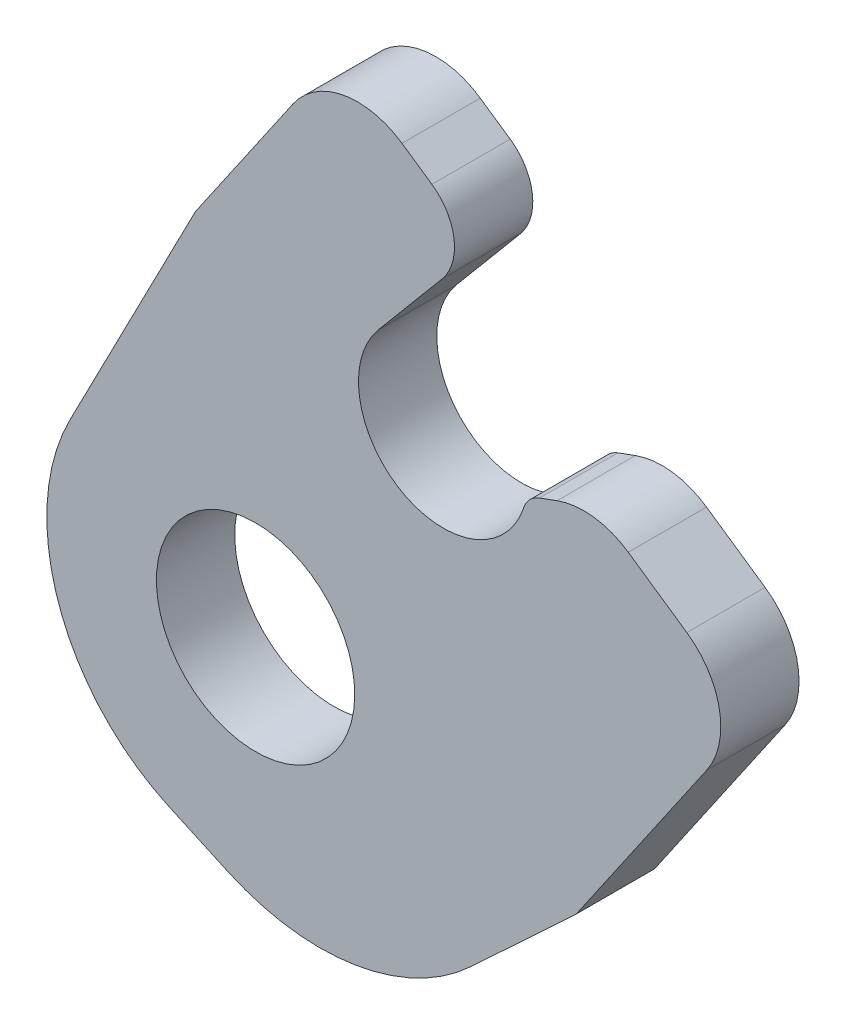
ISO-10303-21;
HEADER;
FILE_DESCRIPTION(('STEP AP214'),'2;1');
FILE_NAME('part.step','',(''),(''),'','','');
FILE_SCHEMA(('AUTOMOTIVE_DESIGN { 1 0 10303 214 1 1 1 1 }'));
ENDSEC;
DATA;
#1=APPLICATION_CONTEXT('core data for automotive mechanical design processes');
#2=APPLICATION_PROTOCOL_DEFINITION('international standard','automotive_design',2000,#1);
#3=PRODUCT_CONTEXT('',#1,'mechanical');
#4=PRODUCT('Part','Part','',(#3));
#5=PRODUCT_RELATED_PRODUCT_CATEGORY('part','',(#4));
#6=PRODUCT_DEFINITION_FORMATION('','',#4);
#7=PRODUCT_DEFINITION_CONTEXT('part definition',#1,'design');
#8=PRODUCT_DEFINITION('design','',#6,#7);
#9=PRODUCT_DEFINITION_SHAPE('','',#8);
#10=(LENGTH_UNIT() NAMED_UNIT(*) SI_UNIT(.MILLI.,.METRE.));
#11=(NAMED_UNIT(*) PLANE_ANGLE_UNIT() SI_UNIT($,.RADIAN.));
#12=(NAMED_UNIT(*) SI_UNIT($,.STERADIAN.) SOLID_ANGLE_UNIT());
#13=UNCERTAINTY_MEASURE_WITH_UNIT(LENGTH_MEASURE(1.E-05),#10,'distance_accuracy_value','');
#14=(GEOMETRIC_REPRESENTATION_CONTEXT(3) GLOBAL_UNCERTAINTY_ASSIGNED_CONTEXT((#13)) GLOBAL_UNIT_ASSIGNED_CONTEXT((#10,
#11,#12)) REPRESENTATION_CONTEXT('',''));
#15=CARTESIAN_POINT('',(0.,0.,0.));
#16=DIRECTION('',(0.,0.,1.));
#17=DIRECTION('',(1.,0.,0.));
#18=AXIS2_PLACEMENT_3D('',#15,#16,#17);
#19=CARTESIAN_POINT('',(-5.5066407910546,10.4664025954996,-3.8));
#20=DIRECTION('',(0.,0.,-1.));
#21=DIRECTION('',(-0.566406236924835,-0.824126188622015,0.));
#22=AXIS2_PLACEMENT_3D('',#19,#20,#21);
#23=CYLINDRICAL_SURFACE('',#22,3.25);
#24=CARTESIAN_POINT('',(-5.5066407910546,10.4664025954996,-3.8));
#25=DIRECTION('',(0.,0.,-1.));
#26=DIRECTION('',(0.566406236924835,0.824126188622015,0.));
#27=AXIS2_PLACEMENT_3D('',#24,#25,#26);
#28=CIRCLE('',#27,3.25);
#29=CARTESIAN_POINT('',(-2.42306138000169,9.43973905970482,-3.8));
#30=VERTEX_POINT('',#29);
#31=CARTESIAN_POINT('',(-7.99628523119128,12.5554623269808,-3.8));
#32=VERTEX_POINT('',#31);
#33=EDGE_CURVE('E135',#30,#32,#28,.T.);
#34=ORIENTED_EDGE('',*,*,#33,.F.);
#35=DIRECTION('',(0.,0.,-1.));
#36=VECTOR('',#35,1.);
#37=CARTESIAN_POINT('',(-2.42306138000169,9.43973905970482,-3.8));
#38=LINE('',#37,#36);
#39=CARTESIAN_POINT('',(-2.42306138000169,9.43973905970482,-6.8));
#40=VERTEX_POINT('',#39);
#41=EDGE_CURVE('E294',#30,#40,#38,.T.);
#42=ORIENTED_EDGE('',*,*,#41,.T.);
#43=CARTESIAN_POINT('',(-5.5066407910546,10.4664025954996,-6.8));
#44=DIRECTION('',(0.,0.,-1.));
#45=DIRECTION('',(0.566406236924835,0.824126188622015,0.));
#46=AXIS2_PLACEMENT_3D('',#43,#44,#45);
#47=CIRCLE('',#46,3.25);
#48=CARTESIAN_POINT('',(-7.99628523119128,12.5554623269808,-6.8));
#49=VERTEX_POINT('',#48);
#50=EDGE_CURVE('E154',#40,#49,#47,.T.);
#51=ORIENTED_EDGE('',*,*,#50,.T.);
#52=DIRECTION('',(0.,0.,-1.));
#53=VECTOR('',#52,1.);
#54=CARTESIAN_POINT('',(-7.99628523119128,12.5554623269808,-3.8));
#55=LINE('',#54,#53);
#56=EDGE_CURVE('E152',#32,#49,#55,.T.);
#57=ORIENTED_EDGE('',*,*,#56,.F.);
#58=EDGE_LOOP('',(#34,#42,#51,#57));
#59=FACE_BOUND('',#58,.T.);
#60=ADVANCED_FACE('F16',(#59),#23,.F.);
#61=CARTESIAN_POINT('',(-7.99628523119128,12.5554623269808,-3.8));
#62=DIRECTION('',(-0.766044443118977,0.642787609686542,0.));
#63=DIRECTION('',(-0.642787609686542,-0.766044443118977,0.));
#64=AXIS2_PLACEMENT_3D('',#61,#62,#63);
#65=PLANE('',#64);
#66=DIRECTION('',(0.642787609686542,0.766044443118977,0.));
#67=VECTOR('',#66,1.);
#68=CARTESIAN_POINT('',(-7.99628523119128,12.5554623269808,-6.8));
#69=LINE('',#68,#67);
#70=CARTESIAN_POINT('',(-5.54445519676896,15.477439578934,-6.8));
#71=VERTEX_POINT('',#70);
#72=EDGE_CURVE('E207',#49,#71,#69,.T.);
#73=ORIENTED_EDGE('',*,*,#72,.T.);
#74=DIRECTION('',(0.,0.,-1.));
#75=VECTOR('',#74,1.);
#76=CARTESIAN_POINT('',(-5.54445519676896,15.477439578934,-3.8));
#77=LINE('',#76,#75);
#78=CARTESIAN_POINT('',(-5.54445519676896,15.477439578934,-3.8));
#79=VERTEX_POINT('',#78);
#80=EDGE_CURVE('E159',#79,#71,#77,.T.);
#81=ORIENTED_EDGE('',*,*,#80,.F.);
#82=DIRECTION('',(0.642787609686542,0.766044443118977,0.));
#83=VECTOR('',#82,1.);
#84=CARTESIAN_POINT('',(-7.99628523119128,12.5554623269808,-3.8));
#85=LINE('',#84,#83);
#86=EDGE_CURVE('E140',#32,#79,#85,.T.);
#87=ORIENTED_EDGE('',*,*,#86,.F.);
#88=ORIENTED_EDGE('',*,*,#56,.T.);
#89=EDGE_LOOP('',(#73,#81,#87,#88));
#90=FACE_BOUND('',#89,.T.);
#91=ADVANCED_FACE('F161',(#90),#65,.F.);
#92=CARTESIAN_POINT('',(-7.07654408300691,16.7630147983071,-3.8));
#93=DIRECTION('',(0.,0.,-1.));
#94=DIRECTION('',(-0.566406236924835,-0.824126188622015,0.));
#95=AXIS2_PLACEMENT_3D('',#92,#93,#94);
#96=CYLINDRICAL_SURFACE('',#95,2.);
#97=CARTESIAN_POINT('',(-7.07654408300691,16.7630147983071,-6.8));
#98=DIRECTION('',(0.,0.,1.));
#99=DIRECTION('',(0.566406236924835,0.824126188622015,0.));
#100=AXIS2_PLACEMENT_3D('',#97,#98,#99);
#101=CIRCLE('',#100,2.);
#102=CARTESIAN_POINT('',(-5.94373160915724,18.4112671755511,-6.8));
#103=VERTEX_POINT('',#102);
#104=EDGE_CURVE('E211',#71,#103,#101,.T.);
#105=ORIENTED_EDGE('',*,*,#104,.T.);
#106=DIRECTION('',(0.,0.,-1.));
#107=VECTOR('',#106,1.);
#108=CARTESIAN_POINT('',(-5.94373160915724,18.4112671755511,-3.8));
#109=LINE('',#108,#107);
#110=CARTESIAN_POINT('',(-5.94373160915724,18.4112671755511,-3.8));
#111=VERTEX_POINT('',#110);
#112=EDGE_CURVE('E263',#111,#103,#109,.T.);
#113=ORIENTED_EDGE('',*,*,#112,.F.);
#114=CARTESIAN_POINT('',(-7.07654408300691,16.7630147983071,-3.8));
#115=DIRECTION('',(0.,0.,1.));
#116=DIRECTION('',(0.566406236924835,0.824126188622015,0.));
#117=AXIS2_PLACEMENT_3D('',#114,#115,#116);
#118=CIRCLE('',#117,2.);
#119=EDGE_CURVE('E165',#79,#111,#118,.T.);
#120=ORIENTED_EDGE('',*,*,#119,.F.);
#121=ORIENTED_EDGE('',*,*,#80,.T.);
#122=EDGE_LOOP('',(#105,#113,#120,#121));
#123=FACE_BOUND('',#122,.T.);
#124=ADVANCED_FACE('F400',(#123),#96,.T.);
#125=CARTESIAN_POINT('',(-5.94373160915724,18.4112671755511,-3.8));
#126=DIRECTION('',(-0.566406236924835,-0.824126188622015,0.));
#127=DIRECTION('',(0.,0.,1.));
#128=AXIS2_PLACEMENT_3D('',#125,#126,#127);
#129=PLANE('',#128);
#130=DIRECTION('',(-0.824126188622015,0.566406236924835,0.));
#131=VECTOR('',#130,1.);
#132=CARTESIAN_POINT('',(-5.94373160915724,18.4112671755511,-6.8));
#133=LINE('',#132,#131);
#134=CARTESIAN_POINT('',(-7.08907017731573,19.1984365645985,-6.8));
#135=VERTEX_POINT('',#134);
#136=EDGE_CURVE('E214',#103,#135,#133,.T.);
#137=ORIENTED_EDGE('',*,*,#136,.T.);
#138=DIRECTION('',(0.,0.,-1.));
#139=VECTOR('',#138,1.);
#140=CARTESIAN_POINT('',(-7.08907017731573,19.1984365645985,-3.8));
#141=LINE('',#140,#139);
#142=CARTESIAN_POINT('',(-7.08907017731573,19.1984365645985,-3.8));
#143=VERTEX_POINT('',#142);
#144=EDGE_CURVE('E260',#143,#135,#141,.T.);
#145=ORIENTED_EDGE('',*,*,#144,.F.);
#146=DIRECTION('',(-0.824126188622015,0.566406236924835,0.));
#147=VECTOR('',#146,1.);
#148=CARTESIAN_POINT('',(-5.94373160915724,18.4112671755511,-3.8));
#149=LINE('',#148,#147);
#150=EDGE_CURVE('E172',#111,#143,#149,.T.);
#151=ORIENTED_EDGE('',*,*,#150,.F.);
#152=ORIENTED_EDGE('',*,*,#112,.T.);
#153=EDGE_LOOP('',(#137,#145,#151,#152));
#154=FACE_BOUND('',#153,.T.);
#155=ADVANCED_FACE('F405',(#154),#129,.F.);
#156=CARTESIAN_POINT('',(-8.78828888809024,16.7260579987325,-3.8));
#157=DIRECTION('',(0.,0.,-1.));
#158=DIRECTION('',(-0.566406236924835,-0.824126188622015,0.));
#159=AXIS2_PLACEMENT_3D('',#156,#157,#158);
#160=CYLINDRICAL_SURFACE('',#159,3.);
#161=CARTESIAN_POINT('',(-8.78828888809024,16.7260579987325,-6.8));
#162=DIRECTION('',(0.,0.,1.));
#163=DIRECTION('',(0.566406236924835,0.824126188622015,0.));
#164=AXIS2_PLACEMENT_3D('',#161,#162,#163);
#165=CIRCLE('',#164,3.);
#166=CARTESIAN_POINT('',(-11.2606674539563,18.4252767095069,-6.8));
#167=VERTEX_POINT('',#166);
#168=EDGE_CURVE('E217',#135,#167,#165,.T.);
#169=ORIENTED_EDGE('',*,*,#168,.T.);
#170=DIRECTION('',(0.,0.,-1.));
#171=VECTOR('',#170,1.);
#172=CARTESIAN_POINT('',(-11.2606674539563,18.4252767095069,-3.8));
#173=LINE('',#172,#171);
#174=CARTESIAN_POINT('',(-11.2606674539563,18.4252767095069,-3.8));
#175=VERTEX_POINT('',#174);
#176=EDGE_CURVE('E256',#175,#167,#173,.T.);
#177=ORIENTED_EDGE('',*,*,#176,.F.);
#178=CARTESIAN_POINT('',(-8.78828888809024,16.7260579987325,-3.8));
#179=DIRECTION('',(0.,0.,1.));
#180=DIRECTION('',(0.566406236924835,0.824126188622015,0.));
#181=AXIS2_PLACEMENT_3D('',#178,#179,#180);
#182=CIRCLE('',#181,3.);
#183=EDGE_CURVE('E178',#143,#175,#182,.T.);
#184=ORIENTED_EDGE('',*,*,#183,.F.);
#185=ORIENTED_EDGE('',*,*,#144,.T.);
#186=EDGE_LOOP('',(#169,#177,#184,#185));
#187=FACE_BOUND('',#186,.T.);
#188=ADVANCED_FACE('F434',(#187),#160,.T.);
#189=CARTESIAN_POINT('',(-11.2606674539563,18.4252767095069,-3.8));
#190=DIRECTION('',(0.824126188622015,-0.566406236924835,0.));
#191=DIRECTION('',(0.,0.,-1.));
#192=AXIS2_PLACEMENT_3D('',#189,#190,#191);
#193=PLANE('',#192);
#194=DIRECTION('',(-0.566406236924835,-0.824126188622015,0.));
#195=VECTOR('',#194,1.);
#196=CARTESIAN_POINT('',(-11.2606674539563,18.4252767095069,-6.8));
#197=LINE('',#196,#195);
#198=CARTESIAN_POINT('',(-15.0037905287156,12.9789988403,-6.8));
#199=VERTEX_POINT('',#198);
#200=EDGE_CURVE('E220',#167,#199,#197,.T.);
#201=ORIENTED_EDGE('',*,*,#200,.T.);
#202=DIRECTION('',(0.,0.,-1.));
#203=VECTOR('',#202,1.);
#204=CARTESIAN_POINT('',(-15.0037905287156,12.9789988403,-3.8));
#205=LINE('',#204,#203);
#206=CARTESIAN_POINT('',(-15.0037905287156,12.9789988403,-3.8));
#207=VERTEX_POINT('',#206);
#208=EDGE_CURVE('E252',#207,#199,#205,.T.);
#209=ORIENTED_EDGE('',*,*,#208,.F.);
#210=DIRECTION('',(-0.566406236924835,-0.824126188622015,0.));
#211=VECTOR('',#210,1.);
#212=CARTESIAN_POINT('',(-11.2606674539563,18.4252767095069,-3.8));
#213=LINE('',#212,#211);
#214=EDGE_CURVE('E181',#175,#207,#213,.T.);
#215=ORIENTED_EDGE('',*,*,#214,.F.);
#216=ORIENTED_EDGE('',*,*,#176,.T.);
#217=EDGE_LOOP('',(#201,#209,#215,#216));
#218=FACE_BOUND('',#217,.T.);
#219=ADVANCED_FACE('F463',(#218),#193,.F.);
#220=CARTESIAN_POINT('',(-15.0037905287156,12.9789988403,-3.8));
#221=DIRECTION('',(0.888617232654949,-0.458649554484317,0.));
#222=DIRECTION('',(0.458649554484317,0.888617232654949,0.));
#223=AXIS2_PLACEMENT_3D('',#220,#221,#222);
#224=PLANE('',#223);
#225=DIRECTION('',(-0.458649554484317,-0.888617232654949,0.));
#226=VECTOR('',#225,1.);
#227=CARTESIAN_POINT('',(-15.0037905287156,12.9789988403,-6.8));
#228=LINE('',#227,#226);
#229=CARTESIAN_POINT('',(-19.8089378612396,3.66919643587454,-6.8));
#230=VERTEX_POINT('',#229);
#231=EDGE_CURVE('E223',#199,#230,#228,.T.);
#232=ORIENTED_EDGE('',*,*,#231,.T.);
#233=DIRECTION('',(0.,0.,-1.));
#234=VECTOR('',#233,1.);
#235=CARTESIAN_POINT('',(-19.8089378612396,3.66919643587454,-3.8));
#236=LINE('',#235,#234);
#237=CARTESIAN_POINT('',(-19.8089378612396,3.66919643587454,-3.8));
#238=VERTEX_POINT('',#237);
#239=EDGE_CURVE('E248',#238,#230,#236,.T.);
#240=ORIENTED_EDGE('',*,*,#239,.F.);
#241=DIRECTION('',(-0.458649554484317,-0.888617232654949,0.));
#242=VECTOR('',#241,1.);
#243=CARTESIAN_POINT('',(-15.0037905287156,12.9789988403,-3.8));
#244=LINE('',#243,#242);
#245=EDGE_CURVE('E184',#207,#238,#244,.T.);
#246=ORIENTED_EDGE('',*,*,#245,.F.);
#247=ORIENTED_EDGE('',*,*,#208,.T.);
#248=EDGE_LOOP('',(#232,#240,#246,#247));
#249=FACE_BOUND('',#248,.T.);
#250=ADVANCED_FACE('F357',(#249),#224,.F.);
#251=CARTESIAN_POINT('',(-12.7,0.,-3.8));
#252=DIRECTION('',(0.,0.,-1.));
#253=DIRECTION('',(-0.566406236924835,-0.824126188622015,0.));
#254=AXIS2_PLACEMENT_3D('',#251,#252,#253);
#255=CYLINDRICAL_SURFACE('',#254,8.);
#256=CARTESIAN_POINT('',(-12.7,0.,-6.8));
#257=DIRECTION('',(0.,0.,1.));
#258=DIRECTION('',(0.566406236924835,0.824126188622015,0.));
#259=AXIS2_PLACEMENT_3D('',#256,#257,#258);
#260=CIRCLE('',#259,8.);
#261=CARTESIAN_POINT('',(-16.0175459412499,-7.27969016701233,-6.8));
#262=VERTEX_POINT('',#261);
#263=EDGE_CURVE('E226',#230,#262,#260,.T.);
#264=ORIENTED_EDGE('',*,*,#263,.T.);
#265=DIRECTION('',(0.,0.,-1.));
#266=VECTOR('',#265,1.);
#267=CARTESIAN_POINT('',(-16.0175459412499,-7.27969016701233,-3.8));
#268=LINE('',#267,#266);
#269=CARTESIAN_POINT('',(-16.0175459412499,-7.27969016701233,-3.8));
#270=VERTEX_POINT('',#269);
#271=EDGE_CURVE('E244',#270,#262,#268,.T.);
#272=ORIENTED_EDGE('',*,*,#271,.F.);
#273=CARTESIAN_POINT('',(-12.7,0.,-3.8));
#274=DIRECTION('',(0.,0.,1.));
#275=DIRECTION('',(0.566406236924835,0.824126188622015,0.));
#276=AXIS2_PLACEMENT_3D('',#273,#274,#275);
#277=CIRCLE('',#276,8.);
#278=EDGE_CURVE('E187',#238,#270,#277,.T.);
#279=ORIENTED_EDGE('',*,*,#278,.F.);
#280=ORIENTED_EDGE('',*,*,#239,.T.);
#281=EDGE_LOOP('',(#264,#272,#279,#280));
#282=FACE_BOUND('',#281,.T.);
#283=ADVANCED_FACE('F351',(#282),#255,.T.);
#284=CARTESIAN_POINT('',(-16.0175459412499,-7.27969016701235,-3.8));
#285=DIRECTION('',(0.414693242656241,0.909961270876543,0.));
#286=DIRECTION('',(-0.909961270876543,0.414693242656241,0.));
#287=AXIS2_PLACEMENT_3D('',#284,#285,#286);
#288=PLANE('',#287);
#289=DIRECTION('',(0.909961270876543,-0.414693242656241,0.));
#290=VECTOR('',#289,1.);
#291=CARTESIAN_POINT('',(-16.0175459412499,-7.27969016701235,-6.8));
#292=LINE('',#291,#290);
#293=CARTESIAN_POINT('',(-13.7560568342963,-8.31031012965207,-6.8));
#294=VERTEX_POINT('',#293);
#295=EDGE_CURVE('E229',#262,#294,#292,.T.);
#296=ORIENTED_EDGE('',*,*,#295,.T.);
#297=DIRECTION('',(0.,0.,-1.));
#298=VECTOR('',#297,1.);
#299=CARTESIAN_POINT('',(-13.7560568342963,-8.31031012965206,-3.8));
#300=LINE('',#299,#298);
#301=CARTESIAN_POINT('',(-13.7560568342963,-8.31031012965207,-3.8));
#302=VERTEX_POINT('',#301);
#303=EDGE_CURVE('E25',#294,#302,#300,.F.);
#304=ORIENTED_EDGE('',*,*,#303,.T.);
#305=DIRECTION('',(0.909961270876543,-0.414693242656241,0.));
#306=VECTOR('',#305,1.);
#307=CARTESIAN_POINT('',(-16.0175459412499,-7.27969016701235,-3.8));
#308=LINE('',#307,#306);
#309=EDGE_CURVE('E190',#270,#302,#308,.T.);
#310=ORIENTED_EDGE('',*,*,#309,.F.);
#311=ORIENTED_EDGE('',*,*,#271,.T.);
#312=EDGE_LOOP('',(#296,#304,#310,#311));
#313=FACE_BOUND('',#312,.T.);
#314=ADVANCED_FACE('F356',(#313),#288,.F.);
#315=CARTESIAN_POINT('',(-8.95480129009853,-11.0076950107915,-3.8));
#316=DIRECTION('',(-0.681998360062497,0.731353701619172,0.));
#317=DIRECTION('',(-0.731353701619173,-0.681998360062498,0.));
#318=AXIS2_PLACEMENT_3D('',#315,#316,#317);
#319=PLANE('',#318);
#320=DIRECTION('',(0.731353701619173,0.681998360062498,0.));
#321=VECTOR('',#320,1.);
#322=CARTESIAN_POINT('',(-8.95480129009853,-11.0076950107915,-3.8));
#323=LINE('',#322,#321);
#324=CARTESIAN_POINT('',(-4.434178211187,-6.7921457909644,-3.8));
#325=VERTEX_POINT('',#324);
#326=CARTESIAN_POINT('',(-0.410421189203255,-3.03993166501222,-3.8));
#327=VERTEX_POINT('',#326);
#328=EDGE_CURVE('E193',#325,#327,#323,.T.);
#329=ORIENTED_EDGE('',*,*,#328,.F.);
#330=DIRECTION('',(0.,0.,-1.));
#331=VECTOR('',#330,1.);
#332=CARTESIAN_POINT('',(-4.43417821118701,-6.79214579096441,-3.8));
#333=LINE('',#332,#331);
#334=CARTESIAN_POINT('',(-4.434178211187,-6.7921457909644,-6.8));
#335=VERTEX_POINT('',#334);
#336=EDGE_CURVE('E305',#325,#335,#333,.T.);
#337=ORIENTED_EDGE('',*,*,#336,.T.);
#338=DIRECTION('',(0.731353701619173,0.681998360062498,0.));
#339=VECTOR('',#338,1.);
#340=CARTESIAN_POINT('',(-8.95480129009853,-11.0076950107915,-6.8));
#341=LINE('',#340,#339);
#342=CARTESIAN_POINT('',(-0.410421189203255,-3.03993166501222,-6.8));
#343=VERTEX_POINT('',#342);
#344=EDGE_CURVE('E232',#335,#343,#341,.T.);
#345=ORIENTED_EDGE('',*,*,#344,.T.);
#346=DIRECTION('',(0.,0.,-1.));
#347=VECTOR('',#346,1.);
#348=CARTESIAN_POINT('',(-0.410421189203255,-3.03993166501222,-3.8));
#349=LINE('',#348,#347);
#350=EDGE_CURVE('E204',#327,#343,#349,.T.);
#351=ORIENTED_EDGE('',*,*,#350,.F.);
#352=EDGE_LOOP('',(#329,#337,#345,#351));
#353=FACE_BOUND('',#352,.T.);
#354=ADVANCED_FACE('F393',(#353),#319,.F.);
#355=CARTESIAN_POINT('',(-0.410421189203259,-3.03993166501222,-3.8));
#356=DIRECTION('',(-0.824126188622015,0.566406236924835,0.));
#357=DIRECTION('',(0.,0.,1.));
#358=AXIS2_PLACEMENT_3D('',#355,#356,#357);
#359=PLANE('',#358);
#360=DIRECTION('',(0.566406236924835,0.824126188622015,0.));
#361=VECTOR('',#360,1.);
#362=CARTESIAN_POINT('',(-0.410421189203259,-3.03993166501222,-6.8));
#363=LINE('',#362,#361);
#364=CARTESIAN_POINT('',(4.59909828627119,4.24896440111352,-6.8));
#365=VERTEX_POINT('',#364);
#366=EDGE_CURVE('E235',#343,#365,#363,.T.);
#367=ORIENTED_EDGE('',*,*,#366,.T.);
#368=DIRECTION('',(0.,0.,1.));
#369=VECTOR('',#368,1.);
#370=CARTESIAN_POINT('',(4.59909828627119,4.24896440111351,-3.8));
#371=LINE('',#370,#369);
#372=CARTESIAN_POINT('',(4.59909828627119,4.24896440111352,-3.8));
#373=VERTEX_POINT('',#372);
#374=EDGE_CURVE('E290',#365,#373,#371,.T.);
#375=ORIENTED_EDGE('',*,*,#374,.T.);
#376=DIRECTION('',(0.566406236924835,0.824126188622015,0.));
#377=VECTOR('',#376,1.);
#378=CARTESIAN_POINT('',(-0.410421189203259,-3.03993166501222,-3.8));
#379=LINE('',#378,#377);
#380=EDGE_CURVE('E196',#327,#373,#379,.T.);
#381=ORIENTED_EDGE('',*,*,#380,.F.);
#382=ORIENTED_EDGE('',*,*,#350,.T.);
#383=EDGE_LOOP('',(#367,#375,#381,#382));
#384=FACE_BOUND('',#383,.T.);
#385=ADVANCED_FACE('F416',(#384),#359,.F.);
#386=CARTESIAN_POINT('',(-12.7,0.,-3.8));
#387=DIRECTION('',(0.,0.,-1.));
#388=DIRECTION('',(-0.566406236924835,-0.824126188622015,0.));
#389=AXIS2_PLACEMENT_3D('',#386,#387,#388);
#390=CYLINDRICAL_SURFACE('',#389,3.8);
#391=CARTESIAN_POINT('',(-12.7,0.,-3.8));
#392=DIRECTION('',(0.,0.,1.));
#393=DIRECTION('',(0.566406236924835,0.824126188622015,0.));
#394=AXIS2_PLACEMENT_3D('',#391,#392,#393);
#395=CIRCLE('',#394,3.8);
#396=CARTESIAN_POINT('',(-10.5476562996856,3.13167951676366,-3.8));
#397=VERTEX_POINT('',#396);
#398=EDGE_CURVE('E200',#397,#397,#395,.T.);
#399=ORIENTED_EDGE('',*,*,#398,.T.);
#400=EDGE_LOOP('',(#399));
#401=FACE_BOUND('',#400,.T.);
#402=CARTESIAN_POINT('',(-12.7,0.,-6.8));
#403=DIRECTION('',(0.,0.,1.));
#404=DIRECTION('',(0.566406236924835,0.824126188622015,0.));
#405=AXIS2_PLACEMENT_3D('',#402,#403,#404);
#406=CIRCLE('',#405,3.8);
#407=CARTESIAN_POINT('',(-10.5476562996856,3.13167951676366,-6.8));
#408=VERTEX_POINT('',#407);
#409=EDGE_CURVE('E149',#408,#408,#406,.T.);
#410=ORIENTED_EDGE('',*,*,#409,.F.);
#411=EDGE_LOOP('',(#410));
#412=FACE_BOUND('',#411,.T.);
#413=ADVANCED_FACE('F445',(#401,#412),#390,.F.);
#414=CARTESIAN_POINT('',(1.68671841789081,20.9328051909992,-3.8));
#415=DIRECTION('',(0.,0.,-1.));
#416=DIRECTION('',(-0.566406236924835,-0.824126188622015,0.));
#417=AXIS2_PLACEMENT_3D('',#414,#415,#416);
#418=PLANE('',#417);
#419=ORIENTED_EDGE('',*,*,#309,.T.);
#420=CARTESIAN_POINT('',(-10.2311642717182,-0.575639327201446,-3.8));
#421=DIRECTION('',(0.,0.,-1.));
#422=DIRECTION('',(-1.,0.,0.));
#423=AXIS2_PLACEMENT_3D('',#420,#421,#422);
#424=CIRCLE('',#423,8.5);
#425=EDGE_CURVE('E11',#302,#325,#424,.F.);
#426=ORIENTED_EDGE('',*,*,#425,.T.);
#427=ORIENTED_EDGE('',*,*,#328,.T.);
#428=ORIENTED_EDGE('',*,*,#380,.T.);
#429=CARTESIAN_POINT('',(2.12671972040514,5.94818311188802,-3.8));
#430=DIRECTION('',(0.,0.,-1.));
#431=DIRECTION('',(-1.,0.,0.));
#432=AXIS2_PLACEMENT_3D('',#429,#430,#431);
#433=CIRCLE('',#432,3.);
#434=CARTESIAN_POINT('',(3.82593843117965,8.42056167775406,-3.8));
#435=VERTEX_POINT('',#434);
#436=EDGE_CURVE('E275',#373,#435,#433,.F.);
#437=ORIENTED_EDGE('',*,*,#436,.T.);
#438=DIRECTION('',(-0.824126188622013,0.566406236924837,0.));
#439=VECTOR('',#438,1.);
#440=CARTESIAN_POINT('',(6.32221306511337,6.70491965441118,-3.8));
#441=LINE('',#440,#439);
#442=CARTESIAN_POINT('',(1.58183557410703,9.96289084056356,-3.8));
#443=VERTEX_POINT('',#442);
#444=EDGE_CURVE('E594',#435,#443,#441,.T.);
#445=ORIENTED_EDGE('',*,*,#444,.T.);
#446=CARTESIAN_POINT('',(-0.117383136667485,7.49051227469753,-3.8));
#447=DIRECTION('',(0.,0.,-1.));
#448=DIRECTION('',(-1.,0.,0.));
#449=AXIS2_PLACEMENT_3D('',#446,#447,#448);
#450=CIRCLE('',#449,3.);
#451=CARTESIAN_POINT('',(-1.14773941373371,10.3080228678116,-3.8));
#452=VERTEX_POINT('',#451);
#453=EDGE_CURVE('E278',#443,#452,#450,.F.);
#454=ORIENTED_EDGE('',*,*,#453,.T.);
#455=DIRECTION('',(-0.939170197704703,-0.34345209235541,0.));
#456=VECTOR('',#455,1.);
#457=CARTESIAN_POINT('',(0.306091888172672,10.8396851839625,-3.8));
#458=LINE('',#457,#456);
#459=CARTESIAN_POINT('',(-1.81771980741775,10.0630127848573,-3.8));
#460=VERTEX_POINT('',#459);
#461=EDGE_CURVE('E590',#452,#460,#458,.T.);
#462=ORIENTED_EDGE('',*,*,#461,.T.);
#463=CARTESIAN_POINT('',(-1.47426771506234,9.12384258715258,-3.8));
#464=DIRECTION('',(0.,0.,-1.));
#465=DIRECTION('',(-1.,0.,0.));
#466=AXIS2_PLACEMENT_3D('',#463,#464,#465);
#467=CIRCLE('',#466,1.);
#468=EDGE_CURVE('E144',#460,#30,#467,.F.);
#469=ORIENTED_EDGE('',*,*,#468,.T.);
#470=ORIENTED_EDGE('',*,*,#33,.T.);
#471=ORIENTED_EDGE('',*,*,#86,.T.);
#472=ORIENTED_EDGE('',*,*,#119,.T.);
#473=ORIENTED_EDGE('',*,*,#150,.T.);
#474=ORIENTED_EDGE('',*,*,#183,.T.);
#475=ORIENTED_EDGE('',*,*,#214,.T.);
#476=ORIENTED_EDGE('',*,*,#245,.T.);
#477=ORIENTED_EDGE('',*,*,#278,.T.);
#478=EDGE_LOOP('',(#419,#426,#427,#428,#437,#445,#454,#462,#469,#470,#471,#472,#473,#474,#475,
#476,#477));
#479=FACE_BOUND('',#478,.T.);
#480=ORIENTED_EDGE('',*,*,#398,.F.);
#481=EDGE_LOOP('',(#480));
#482=FACE_BOUND('',#481,.T.);
#483=ADVANCED_FACE('F137',(#479,#482),#418,.F.);
#484=CARTESIAN_POINT('',(1.68671841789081,20.9328051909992,-6.8));
#485=DIRECTION('',(0.,0.,-1.));
#486=DIRECTION('',(-0.566406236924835,-0.824126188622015,0.));
#487=AXIS2_PLACEMENT_3D('',#484,#485,#486);
#488=PLANE('',#487);
#489=ORIENTED_EDGE('',*,*,#344,.F.);
#490=CARTESIAN_POINT('',(-10.2311642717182,-0.575639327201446,-6.8));
#491=DIRECTION('',(0.,0.,-1.));
#492=DIRECTION('',(-1.,0.,0.));
#493=AXIS2_PLACEMENT_3D('',#490,#491,#492);
#494=CIRCLE('',#493,8.5);
#495=EDGE_CURVE('E39',#335,#294,#494,.T.);
#496=ORIENTED_EDGE('',*,*,#495,.T.);
#497=ORIENTED_EDGE('',*,*,#295,.F.);
#498=ORIENTED_EDGE('',*,*,#263,.F.);
#499=ORIENTED_EDGE('',*,*,#231,.F.);
#500=ORIENTED_EDGE('',*,*,#200,.F.);
#501=ORIENTED_EDGE('',*,*,#168,.F.);
#502=ORIENTED_EDGE('',*,*,#136,.F.);
#503=ORIENTED_EDGE('',*,*,#104,.F.);
#504=ORIENTED_EDGE('',*,*,#72,.F.);
#505=ORIENTED_EDGE('',*,*,#50,.F.);
#506=CARTESIAN_POINT('',(-1.47426771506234,9.12384258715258,-6.8));
#507=DIRECTION('',(0.,0.,-1.));
#508=DIRECTION('',(-1.,0.,0.));
#509=AXIS2_PLACEMENT_3D('',#506,#507,#508);
#510=CIRCLE('',#509,1.);
#511=CARTESIAN_POINT('',(-1.81771980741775,10.0630127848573,-6.8));
#512=VERTEX_POINT('',#511);
#513=EDGE_CURVE('E297',#40,#512,#510,.T.);
#514=ORIENTED_EDGE('',*,*,#513,.T.);
#515=DIRECTION('',(-0.939170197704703,-0.34345209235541,0.));
#516=VECTOR('',#515,1.);
#517=CARTESIAN_POINT('',(0.306091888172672,10.8396851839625,-6.8));
#518=LINE('',#517,#516);
#519=CARTESIAN_POINT('',(-1.14773941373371,10.3080228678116,-6.8));
#520=VERTEX_POINT('',#519);
#521=EDGE_CURVE('E208',#520,#512,#518,.T.);
#522=ORIENTED_EDGE('',*,*,#521,.F.);
#523=CARTESIAN_POINT('',(-0.117383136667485,7.49051227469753,-6.8));
#524=DIRECTION('',(0.,0.,-1.));
#525=DIRECTION('',(-1.,0.,0.));
#526=AXIS2_PLACEMENT_3D('',#523,#524,#525);
#527=CIRCLE('',#526,3.);
#528=CARTESIAN_POINT('',(1.58183557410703,9.96289084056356,-6.8));
#529=VERTEX_POINT('',#528);
#530=EDGE_CURVE('E287',#520,#529,#527,.T.);
#531=ORIENTED_EDGE('',*,*,#530,.T.);
#532=DIRECTION('',(-0.824126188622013,0.566406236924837,0.));
#533=VECTOR('',#532,1.);
#534=CARTESIAN_POINT('',(6.32221306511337,6.70491965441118,-6.8));
#535=LINE('',#534,#533);
#536=CARTESIAN_POINT('',(3.82593843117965,8.42056167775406,-6.8));
#537=VERTEX_POINT('',#536);
#538=EDGE_CURVE('E593',#537,#529,#535,.T.);
#539=ORIENTED_EDGE('',*,*,#538,.F.);
#540=CARTESIAN_POINT('',(2.12671972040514,5.94818311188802,-6.8));
#541=DIRECTION('',(0.,0.,-1.));
#542=DIRECTION('',(-1.,0.,0.));
#543=AXIS2_PLACEMENT_3D('',#540,#541,#542);
#544=CIRCLE('',#543,3.);
#545=EDGE_CURVE('E284',#537,#365,#544,.T.);
#546=ORIENTED_EDGE('',*,*,#545,.T.);
#547=ORIENTED_EDGE('',*,*,#366,.F.);
#548=EDGE_LOOP('',(#489,#496,#497,#498,#499,#500,#501,#502,#503,#504,#505,#514,#522,#531,#539,
#546,#547));
#549=FACE_BOUND('',#548,.T.);
#550=ORIENTED_EDGE('',*,*,#409,.T.);
#551=EDGE_LOOP('',(#550));
#552=FACE_BOUND('',#551,.T.);
#553=ADVANCED_FACE('F317',(#549,#552),#488,.T.);
#554=CARTESIAN_POINT('',(6.32221306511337,6.70491965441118,-6.8));
#555=DIRECTION('',(0.566406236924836,0.824126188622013,0.));
#556=DIRECTION('',(-0.824126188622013,0.566406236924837,0.));
#557=AXIS2_PLACEMENT_3D('',#554,#555,#556);
#558=PLANE('',#557);
#559=ORIENTED_EDGE('',*,*,#538,.T.);
#560=DIRECTION('',(0.,0.,1.));
#561=VECTOR('',#560,1.);
#562=CARTESIAN_POINT('',(1.58183557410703,9.96289084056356,-6.8));
#563=LINE('',#562,#561);
#564=EDGE_CURVE('E271',#529,#443,#563,.T.);
#565=ORIENTED_EDGE('',*,*,#564,.T.);
#566=ORIENTED_EDGE('',*,*,#444,.F.);
#567=DIRECTION('',(0.,0.,1.));
#568=VECTOR('',#567,1.);
#569=CARTESIAN_POINT('',(3.82593843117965,8.42056167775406,-6.8));
#570=LINE('',#569,#568);
#571=EDGE_CURVE('E158',#435,#537,#570,.F.);
#572=ORIENTED_EDGE('',*,*,#571,.T.);
#573=EDGE_LOOP('',(#559,#565,#566,#572));
#574=FACE_BOUND('',#573,.T.);
#575=ADVANCED_FACE('F322',(#574),#558,.T.);
#576=CARTESIAN_POINT('',(0.306091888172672,10.8396851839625,-6.8));
#577=DIRECTION('',(-0.34345209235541,0.939170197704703,0.));
#578=DIRECTION('',(-0.939170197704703,-0.34345209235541,0.));
#579=AXIS2_PLACEMENT_3D('',#576,#577,#578);
#580=PLANE('',#579);
#581=ORIENTED_EDGE('',*,*,#521,.T.);
#582=DIRECTION('',(0.,0.,1.));
#583=VECTOR('',#582,1.);
#584=CARTESIAN_POINT('',(-1.81771980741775,10.0630127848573,-3.8));
#585=LINE('',#584,#583);
#586=EDGE_CURVE('E300',#512,#460,#585,.T.);
#587=ORIENTED_EDGE('',*,*,#586,.T.);
#588=ORIENTED_EDGE('',*,*,#461,.F.);
#589=DIRECTION('',(0.,0.,1.));
#590=VECTOR('',#589,1.);
#591=CARTESIAN_POINT('',(-1.14773941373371,10.3080228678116,-6.8));
#592=LINE('',#591,#590);
#593=EDGE_CURVE('E281',#452,#520,#592,.F.);
#594=ORIENTED_EDGE('',*,*,#593,.T.);
#595=EDGE_LOOP('',(#581,#587,#588,#594));
#596=FACE_BOUND('',#595,.T.);
#597=ADVANCED_FACE('F340',(#596),#580,.T.);
#598=CARTESIAN_POINT('',(-0.117383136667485,7.49051227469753,-6.8));
#599=DIRECTION('',(0.,0.,1.));
#600=DIRECTION('',(1.,0.,0.));
#601=AXIS2_PLACEMENT_3D('',#598,#599,#600);
#602=CYLINDRICAL_SURFACE('',#601,3.);
#603=ORIENTED_EDGE('',*,*,#530,.F.);
#604=ORIENTED_EDGE('',*,*,#593,.F.);
#605=ORIENTED_EDGE('',*,*,#453,.F.);
#606=ORIENTED_EDGE('',*,*,#564,.F.);
#607=EDGE_LOOP('',(#603,#604,#605,#606));
#608=FACE_BOUND('',#607,.T.);
#609=ADVANCED_FACE('F334',(#608),#602,.T.);
#610=CARTESIAN_POINT('',(2.12671972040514,5.94818311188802,-3.8));
#611=DIRECTION('',(0.,0.,-1.));
#612=DIRECTION('',(-1.,0.,0.));
#613=AXIS2_PLACEMENT_3D('',#610,#611,#612);
#614=CYLINDRICAL_SURFACE('',#613,3.);
#615=ORIENTED_EDGE('',*,*,#545,.F.);
#616=ORIENTED_EDGE('',*,*,#571,.F.);
#617=ORIENTED_EDGE('',*,*,#436,.F.);
#618=ORIENTED_EDGE('',*,*,#374,.F.);
#619=EDGE_LOOP('',(#615,#616,#617,#618));
#620=FACE_BOUND('',#619,.T.);
#621=ADVANCED_FACE('F339',(#620),#614,.T.);
#622=CARTESIAN_POINT('',(-1.47426771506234,9.12384258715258,-3.8));
#623=DIRECTION('',(0.,0.,-1.));
#624=DIRECTION('',(-1.,0.,0.));
#625=AXIS2_PLACEMENT_3D('',#622,#623,#624);
#626=CYLINDRICAL_SURFACE('',#625,1.);
#627=ORIENTED_EDGE('',*,*,#468,.F.);
#628=ORIENTED_EDGE('',*,*,#586,.F.);
#629=ORIENTED_EDGE('',*,*,#513,.F.);
#630=ORIENTED_EDGE('',*,*,#41,.F.);
#631=EDGE_LOOP('',(#627,#628,#629,#630));
#632=FACE_BOUND('',#631,.T.);
#633=ADVANCED_FACE('F381',(#632),#626,.T.);
#634=CARTESIAN_POINT('',(-10.2311642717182,-0.575639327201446,-3.8));
#635=DIRECTION('',(0.,0.,-1.));
#636=DIRECTION('',(-1.,0.,0.));
#637=AXIS2_PLACEMENT_3D('',#634,#635,#636);
#638=CYLINDRICAL_SURFACE('',#637,8.5);
#639=ORIENTED_EDGE('',*,*,#425,.F.);
#640=ORIENTED_EDGE('',*,*,#303,.F.);
#641=ORIENTED_EDGE('',*,*,#495,.F.);
#642=ORIENTED_EDGE('',*,*,#336,.F.);
#643=EDGE_LOOP('',(#639,#640,#641,#642));
#644=FACE_BOUND('',#643,.T.);
#645=ADVANCED_FACE('F18',(#644),#638,.T.);
#646=CLOSED_SHELL('',(#60,#91,#124,#155,#188,#219,#250,#283,#314,#354,#385,#413,#483,#553,#575,
#597,#609,#621,#633,#645));
#647=MANIFOLD_SOLID_BREP('B1',#646);
#648=ADVANCED_BREP_SHAPE_REPRESENTATION('',(#18,#647),#14);
#649=SHAPE_DEFINITION_REPRESENTATION(#9,#648);
ENDSEC;
END-ISO-10303-21;
